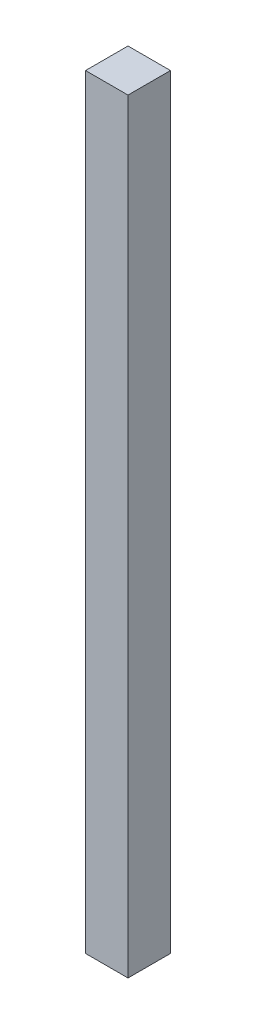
from build123d import *

# Parameters (mm, degrees)
SKIZZE1_W                       = 50
SKIZZE1_H                       = 50
AUFSATZ_LINEAR_AUSTRAGEN1_DEPTH = 900


with BuildPart() as part:
    # Skizze1 → Aufsatz-Linear austragen1 (new body)
    with BuildSketch(Plane(origin=(0, 0, 0), x_dir=(1, 0, 0), z_dir=(0, 1, 0))):
        Rectangle(SKIZZE1_W, SKIZZE1_H)
    extrude(amount=AUFSATZ_LINEAR_AUSTRAGEN1_DEPTH)


solid = part.part
